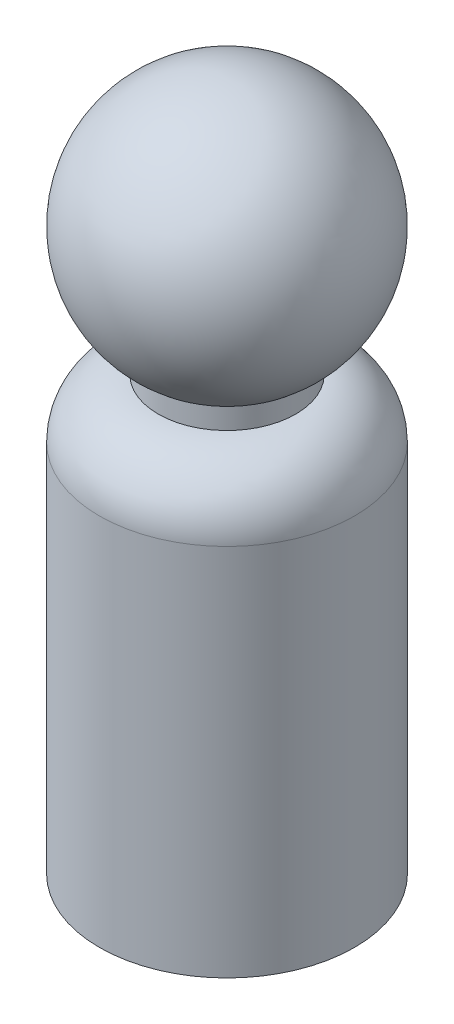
ISO-10303-21;
HEADER;
FILE_DESCRIPTION(('STEP AP214'),'2;1');
FILE_NAME('part.step','',(''),(''),'','','');
FILE_SCHEMA(('AUTOMOTIVE_DESIGN { 1 0 10303 214 1 1 1 1 }'));
ENDSEC;
DATA;
#1=APPLICATION_CONTEXT('core data for automotive mechanical design processes');
#2=APPLICATION_PROTOCOL_DEFINITION('international standard','automotive_design',2000,#1);
#3=PRODUCT_CONTEXT('',#1,'mechanical');
#4=PRODUCT('Part','Part','',(#3));
#5=PRODUCT_RELATED_PRODUCT_CATEGORY('part','',(#4));
#6=PRODUCT_DEFINITION_FORMATION('','',#4);
#7=PRODUCT_DEFINITION_CONTEXT('part definition',#1,'design');
#8=PRODUCT_DEFINITION('design','',#6,#7);
#9=PRODUCT_DEFINITION_SHAPE('','',#8);
#10=(LENGTH_UNIT() NAMED_UNIT(*) SI_UNIT(.MILLI.,.METRE.));
#11=(NAMED_UNIT(*) PLANE_ANGLE_UNIT() SI_UNIT($,.RADIAN.));
#12=(NAMED_UNIT(*) SI_UNIT($,.STERADIAN.) SOLID_ANGLE_UNIT());
#13=UNCERTAINTY_MEASURE_WITH_UNIT(LENGTH_MEASURE(1.E-05),#10,'distance_accuracy_value','');
#14=(GEOMETRIC_REPRESENTATION_CONTEXT(3) GLOBAL_UNCERTAINTY_ASSIGNED_CONTEXT((#13)) GLOBAL_UNIT_ASSIGNED_CONTEXT((#10,
#11,#12)) REPRESENTATION_CONTEXT('',''));
#15=CARTESIAN_POINT('',(0.,0.,0.));
#16=DIRECTION('',(0.,0.,1.));
#17=DIRECTION('',(1.,0.,0.));
#18=AXIS2_PLACEMENT_3D('',#15,#16,#17);
#19=CARTESIAN_POINT('',(0.,38.1,0.));
#20=DIRECTION('',(0.,-1.,0.));
#21=DIRECTION('',(0.,0.,-1.));
#22=AXIS2_PLACEMENT_3D('',#19,#20,#21);
#23=CYLINDRICAL_SURFACE('',#22,11.2395);
#24=CARTESIAN_POINT('',(0.,32.9184,0.));
#25=DIRECTION('',(0.,1.,0.));
#26=DIRECTION('',(0.,0.,1.));
#27=AXIS2_PLACEMENT_3D('',#24,#25,#26);
#28=CIRCLE('',#27,11.2395);
#29=CARTESIAN_POINT('',(0.,32.9184,-11.2395));
#30=VERTEX_POINT('',#29);
#31=EDGE_CURVE('E10',#30,#30,#28,.F.);
#32=CARTESIAN_POINT('',(0.,0.,0.));
#33=DIRECTION('',(0.,1.,0.));
#34=DIRECTION('',(0.,0.,1.));
#35=AXIS2_PLACEMENT_3D('',#32,#33,#34);
#36=CIRCLE('',#35,11.2395);
#37=CARTESIAN_POINT('',(0.,0.,-11.2395));
#38=VERTEX_POINT('',#37);
#39=EDGE_CURVE('E43',#38,#38,#36,.T.);
#40=CARTESIAN_POINT('',(0.,32.9184,-11.2395));
#41=CARTESIAN_POINT('',(0.,32.5755,-11.2395));
#42=CARTESIAN_POINT('',(0.,32.2326,-11.2395));
#43=CARTESIAN_POINT('',(0.,31.5468,-11.2395));
#44=CARTESIAN_POINT('',(0.,31.2039,-11.2395));
#45=CARTESIAN_POINT('',(0.,30.5181,-11.2395));
#46=CARTESIAN_POINT('',(0.,30.1752,-11.2395));
#47=CARTESIAN_POINT('',(0.,29.4894,-11.2395));
#48=CARTESIAN_POINT('',(0.,29.1465,-11.2395));
#49=CARTESIAN_POINT('',(0.,28.4607,-11.2395));
#50=CARTESIAN_POINT('',(0.,28.1178,-11.2395));
#51=CARTESIAN_POINT('',(0.,27.432,-11.2395));
#52=CARTESIAN_POINT('',(0.,27.0891,-11.2395));
#53=CARTESIAN_POINT('',(0.,26.4033,-11.2395));
#54=CARTESIAN_POINT('',(0.,26.0604,-11.2395));
#55=CARTESIAN_POINT('',(0.,25.3746,-11.2395));
#56=CARTESIAN_POINT('',(0.,25.0317,-11.2395));
#57=CARTESIAN_POINT('',(0.,24.3459,-11.2395));
#58=CARTESIAN_POINT('',(0.,24.003,-11.2395));
#59=CARTESIAN_POINT('',(0.,23.3172,-11.2395));
#60=CARTESIAN_POINT('',(0.,22.9743,-11.2395));
#61=CARTESIAN_POINT('',(0.,22.2885,-11.2395));
#62=CARTESIAN_POINT('',(0.,21.9456,-11.2395));
#63=CARTESIAN_POINT('',(0.,21.2598,-11.2395));
#64=CARTESIAN_POINT('',(0.,20.9169,-11.2395));
#65=CARTESIAN_POINT('',(0.,20.2311,-11.2395));
#66=CARTESIAN_POINT('',(0.,19.8882,-11.2395));
#67=CARTESIAN_POINT('',(0.,19.2024,-11.2395));
#68=CARTESIAN_POINT('',(0.,18.8595,-11.2395));
#69=CARTESIAN_POINT('',(0.,18.1737,-11.2395));
#70=CARTESIAN_POINT('',(0.,17.8308,-11.2395));
#71=CARTESIAN_POINT('',(0.,17.145,-11.2395));
#72=CARTESIAN_POINT('',(0.,16.8021,-11.2395));
#73=CARTESIAN_POINT('',(0.,16.1163,-11.2395));
#74=CARTESIAN_POINT('',(0.,15.7734,-11.2395));
#75=CARTESIAN_POINT('',(0.,15.0876,-11.2395));
#76=CARTESIAN_POINT('',(0.,14.7447,-11.2395));
#77=CARTESIAN_POINT('',(0.,14.0589,-11.2395));
#78=CARTESIAN_POINT('',(0.,13.716,-11.2395));
#79=CARTESIAN_POINT('',(0.,13.0302,-11.2395));
#80=CARTESIAN_POINT('',(0.,12.6873,-11.2395));
#81=CARTESIAN_POINT('',(0.,12.0015,-11.2395));
#82=CARTESIAN_POINT('',(0.,11.6586,-11.2395));
#83=CARTESIAN_POINT('',(0.,10.9728,-11.2395));
#84=CARTESIAN_POINT('',(0.,10.6299,-11.2395));
#85=CARTESIAN_POINT('',(0.,9.9441,-11.2395));
#86=CARTESIAN_POINT('',(0.,9.6012,-11.2395));
#87=CARTESIAN_POINT('',(0.,8.9154,-11.2395));
#88=CARTESIAN_POINT('',(0.,8.5725,-11.2395));
#89=CARTESIAN_POINT('',(0.,7.8867,-11.2395));
#90=CARTESIAN_POINT('',(0.,7.5438,-11.2395));
#91=CARTESIAN_POINT('',(0.,6.858,-11.2395));
#92=CARTESIAN_POINT('',(0.,6.5151,-11.2395));
#93=CARTESIAN_POINT('',(0.,5.8293,-11.2395));
#94=CARTESIAN_POINT('',(0.,5.4864,-11.2395));
#95=CARTESIAN_POINT('',(0.,4.8006,-11.2395));
#96=CARTESIAN_POINT('',(0.,4.4577,-11.2395));
#97=CARTESIAN_POINT('',(0.,3.7719,-11.2395));
#98=CARTESIAN_POINT('',(0.,3.429,-11.2395));
#99=CARTESIAN_POINT('',(0.,2.7432,-11.2395));
#100=CARTESIAN_POINT('',(0.,2.4003,-11.2395));
#101=CARTESIAN_POINT('',(0.,1.7145,-11.2395));
#102=CARTESIAN_POINT('',(0.,1.3716,-11.2395));
#103=CARTESIAN_POINT('',(0.,0.685800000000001,-11.2395));
#104=CARTESIAN_POINT('',(0.,0.342900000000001,-11.2395));
#105=CARTESIAN_POINT('',(0.,0.,-11.2395));
#106=B_SPLINE_CURVE_WITH_KNOTS('',3,(#40,#41,#42,#43,#44,#45,#46,#47,#48,#49,#50,#51,#52,#53,
#54,#55,#56,#57,#58,#59,#60,#61,#62,#63,#64,#65,#66,#67,#68,#69,#70,#71,#72,#73,#74,#75,#76,#77,
#78,#79,#80,#81,#82,#83,#84,#85,#86,#87,#88,#89,#90,#91,#92,#93,#94,#95,#96,#97,#98,#99,#100,
#101,#102,#103,#104,#105),.UNSPECIFIED.,.F.,.F.,(4,2,2,2,2,2,2,2,2,2,2,2,2,2,2,2,2,2,2,2,2,2,2,
2,2,2,2,2,2,2,2,2,4),(0.,1.0287,2.0574,3.08609999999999,4.11479999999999,5.1435,6.1722,7.2009,
8.2296,9.2583,10.287,11.3157,12.3444,13.3731,14.4018,15.4305,16.4592,17.4879,18.5166,19.5453,
20.574,21.6027,22.6314,23.6601,24.6888,25.7175,26.7462,27.7749,28.8036,29.8323,30.861,31.8897,
32.9184),.UNSPECIFIED.);
#107=EDGE_CURVE('BSEAM32',#30,#38,#106,.T.);
#108=ORIENTED_EDGE('',*,*,#31,.T.);
#109=ORIENTED_EDGE('',*,*,#39,.T.);
#110=ORIENTED_EDGE('',*,*,#107,.T.);
#111=ORIENTED_EDGE('',*,*,#107,.F.);
#112=EDGE_LOOP('',(#108,#110,#109,#111));
#113=FACE_BOUND('',#112,.T.);
#114=ADVANCED_FACE('F32',(#113),#23,.T.);
#115=CARTESIAN_POINT('',(0.,0.,0.));
#116=DIRECTION('',(0.,1.,0.));
#117=DIRECTION('',(0.,0.,1.));
#118=AXIS2_PLACEMENT_3D('',#115,#116,#117);
#119=PLANE('',#118);
#120=ORIENTED_EDGE('',*,*,#39,.F.);
#121=EDGE_LOOP('',(#120));
#122=FACE_BOUND('',#121,.T.);
#123=ADVANCED_FACE('F63',(#122),#119,.F.);
#124=CARTESIAN_POINT('',(0.,32.9184,0.));
#125=DIRECTION('',(0.,1.,0.));
#126=DIRECTION('',(0.,0.,1.));
#127=AXIS2_PLACEMENT_3D('',#124,#125,#126);
#128=TOROIDAL_SURFACE('',#127,6.0579,5.1816);
#129=ORIENTED_EDGE('',*,*,#31,.F.);
#130=EDGE_LOOP('',(#129));
#131=FACE_BOUND('',#130,.T.);
#132=CARTESIAN_POINT('',(0.,38.1,0.));
#133=DIRECTION('',(0.,1.,0.));
#134=DIRECTION('',(0.,0.,1.));
#135=AXIS2_PLACEMENT_3D('',#132,#133,#134);
#136=CIRCLE('',#135,6.0579);
#137=CARTESIAN_POINT('',(0.,38.1,6.0579));
#138=VERTEX_POINT('',#137);
#139=EDGE_CURVE('E39',#138,#138,#136,.T.);
#140=ORIENTED_EDGE('',*,*,#139,.F.);
#141=EDGE_LOOP('',(#140));
#142=FACE_BOUND('',#141,.T.);
#143=ADVANCED_FACE('F34',(#131,#142),#128,.T.);
#144=CARTESIAN_POINT('',(0.,39.9415,0.));
#145=DIRECTION('',(0.,-1.,0.));
#146=DIRECTION('',(0.,0.,-1.));
#147=AXIS2_PLACEMENT_3D('',#144,#145,#146);
#148=CYLINDRICAL_SURFACE('',#147,6.0579);
#149=CARTESIAN_POINT('',(0.,39.9415,0.));
#150=DIRECTION('',(0.,1.,0.));
#151=DIRECTION('',(0.,0.,1.));
#152=AXIS2_PLACEMENT_3D('',#149,#150,#151);
#153=CIRCLE('',#152,6.0579);
#154=CARTESIAN_POINT('',(0.,39.9415,6.0579));
#155=VERTEX_POINT('',#154);
#156=EDGE_CURVE('E47',#155,#155,#153,.T.);
#157=ORIENTED_EDGE('',*,*,#156,.F.);
#158=EDGE_LOOP('',(#157));
#159=FACE_BOUND('',#158,.T.);
#160=ORIENTED_EDGE('',*,*,#139,.T.);
#161=EDGE_LOOP('',(#160));
#162=FACE_BOUND('',#161,.T.);
#163=ADVANCED_FACE('F55',(#159,#162),#148,.T.);
#164=CARTESIAN_POINT('',(0.,49.4087175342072,0.));
#165=DIRECTION('',(0.,1.,0.));
#166=DIRECTION('',(1.,0.,0.));
#167=AXIS2_PLACEMENT_3D('',#164,#165,#166);
#168=SPHERICAL_SURFACE('',#167,11.2395);
#169=ORIENTED_EDGE('',*,*,#156,.T.);
#170=EDGE_LOOP('',(#169));
#171=FACE_BOUND('',#170,.T.);
#172=ADVANCED_FACE('F53',(#171),#168,.T.);
#173=CLOSED_SHELL('',(#114,#123,#143,#163,#172));
#174=MANIFOLD_SOLID_BREP('B2',#173);
#175=ADVANCED_BREP_SHAPE_REPRESENTATION('',(#18,#174),#14);
#176=SHAPE_DEFINITION_REPRESENTATION(#9,#175);
ENDSEC;
END-ISO-10303-21;
